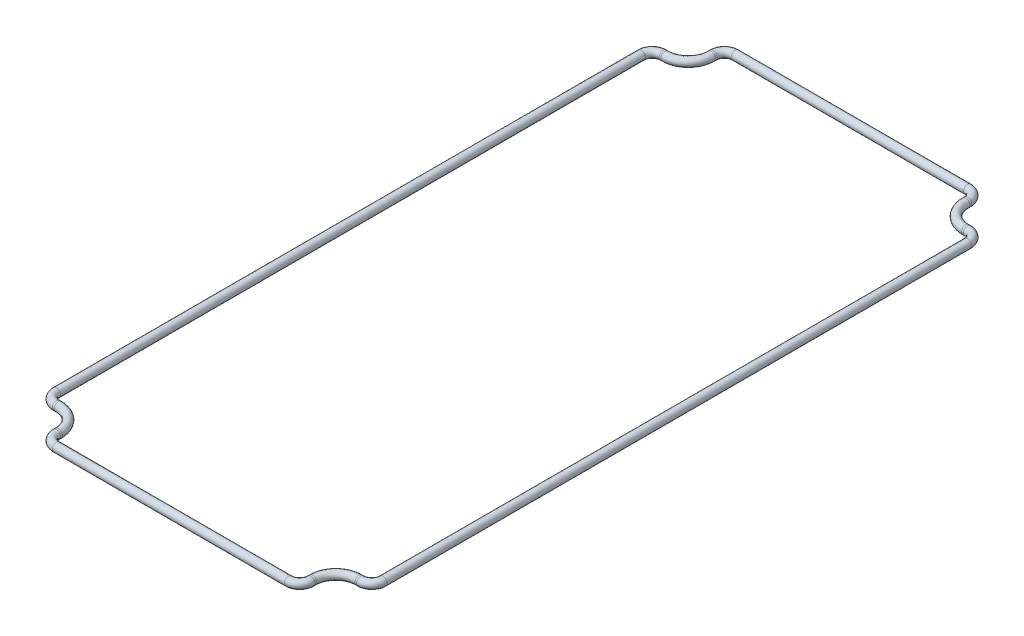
ISO-10303-21;
HEADER;
FILE_DESCRIPTION(('STEP AP214'),'2;1');
FILE_NAME('part.step','',(''),(''),'','','');
FILE_SCHEMA(('AUTOMOTIVE_DESIGN { 1 0 10303 214 1 1 1 1 }'));
ENDSEC;
DATA;
#1=APPLICATION_CONTEXT('core data for automotive mechanical design processes');
#2=APPLICATION_PROTOCOL_DEFINITION('international standard','automotive_design',2000,#1);
#3=PRODUCT_CONTEXT('',#1,'mechanical');
#4=PRODUCT('Part','Part','',(#3));
#5=PRODUCT_RELATED_PRODUCT_CATEGORY('part','',(#4));
#6=PRODUCT_DEFINITION_FORMATION('','',#4);
#7=PRODUCT_DEFINITION_CONTEXT('part definition',#1,'design');
#8=PRODUCT_DEFINITION('design','',#6,#7);
#9=PRODUCT_DEFINITION_SHAPE('','',#8);
#10=(LENGTH_UNIT() NAMED_UNIT(*) SI_UNIT(.MILLI.,.METRE.));
#11=(NAMED_UNIT(*) PLANE_ANGLE_UNIT() SI_UNIT($,.RADIAN.));
#12=(NAMED_UNIT(*) SI_UNIT($,.STERADIAN.) SOLID_ANGLE_UNIT());
#13=UNCERTAINTY_MEASURE_WITH_UNIT(LENGTH_MEASURE(1.E-05),#10,'distance_accuracy_value','');
#14=(GEOMETRIC_REPRESENTATION_CONTEXT(3) GLOBAL_UNCERTAINTY_ASSIGNED_CONTEXT((#13)) GLOBAL_UNIT_ASSIGNED_CONTEXT((#10,
#11,#12)) REPRESENTATION_CONTEXT('',''));
#15=CARTESIAN_POINT('',(0.,0.,0.));
#16=DIRECTION('',(0.,0.,1.));
#17=DIRECTION('',(1.,0.,0.));
#18=AXIS2_PLACEMENT_3D('',#15,#16,#17);
#19=CARTESIAN_POINT('',(43.38664,26.035,83.34964));
#20=DIRECTION('',(0.,1.,0.));
#21=DIRECTION('',(0.,0.,1.));
#22=AXIS2_PLACEMENT_3D('',#19,#20,#21);
#23=TOROIDAL_SURFACE('',#22,3.14705999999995,1.190625);
#24=CARTESIAN_POINT('',(43.38664,26.035,86.4966999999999));
#25=DIRECTION('',(-1.,0.,0.));
#26=DIRECTION('',(0.,0.,1.));
#27=AXIS2_PLACEMENT_3D('',#24,#25,#26);
#28=CIRCLE('',#27,1.190625);
#29=CARTESIAN_POINT('',(43.3866399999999,26.035,87.6873249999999));
#30=VERTEX_POINT('',#29);
#31=EDGE_CURVE('E28',#30,#30,#28,.T.);
#32=CARTESIAN_POINT('',(46.5336999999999,26.035,83.34964));
#33=DIRECTION('',(0.,0.,1.));
#34=DIRECTION('',(1.,0.,0.));
#35=AXIS2_PLACEMENT_3D('',#32,#33,#34);
#36=CIRCLE('',#35,1.190625);
#37=CARTESIAN_POINT('',(47.724325,26.035,83.3496400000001));
#38=VERTEX_POINT('',#37);
#39=EDGE_CURVE('E10',#38,#38,#36,.T.);
#40=CARTESIAN_POINT('',(43.38664,26.035,83.34964));
#41=DIRECTION('',(0.,1.,0.));
#42=DIRECTION('',(0.,0.,1.));
#43=AXIS2_PLACEMENT_3D('',#40,#41,#42);
#44=CIRCLE('',#43,4.33768499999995);
#45=EDGE_CURVE('',#30,#38,#44,.T.);
#46=ORIENTED_EDGE('',*,*,#31,.F.);
#47=ORIENTED_EDGE('',*,*,#39,.T.);
#48=ORIENTED_EDGE('',*,*,#45,.T.);
#49=ORIENTED_EDGE('',*,*,#45,.F.);
#50=EDGE_LOOP('',(#46,#48,#47,#49));
#51=FACE_BOUND('',#50,.T.);
#52=ADVANCED_FACE('F22',(#51),#23,.T.);
#53=CARTESIAN_POINT('',(42.84816,26.035,86.4966999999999));
#54=DIRECTION('',(1.,0.,0.));
#55=DIRECTION('',(0.,0.,-1.));
#56=AXIS2_PLACEMENT_3D('',#53,#54,#55);
#57=CYLINDRICAL_SURFACE('',#56,1.190625);
#58=CARTESIAN_POINT('',(42.84816,26.035,86.4966999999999));
#59=DIRECTION('',(-1.,0.,0.));
#60=DIRECTION('',(0.,0.,1.));
#61=AXIS2_PLACEMENT_3D('',#58,#59,#60);
#62=CIRCLE('',#61,1.190625);
#63=CARTESIAN_POINT('',(42.84816,26.035,85.3060749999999));
#64=VERTEX_POINT('',#63);
#65=EDGE_CURVE('E32',#64,#64,#62,.T.);
#66=ORIENTED_EDGE('',*,*,#65,.F.);
#67=EDGE_LOOP('',(#66));
#68=FACE_BOUND('',#67,.T.);
#69=ORIENTED_EDGE('',*,*,#31,.T.);
#70=EDGE_LOOP('',(#69));
#71=FACE_BOUND('',#70,.T.);
#72=ADVANCED_FACE('F228',(#68,#71),#57,.T.);
#73=CARTESIAN_POINT('',(42.84816,26.035,93.09816));
#74=DIRECTION('',(0.,-1.,0.));
#75=DIRECTION('',(0.,0.,-1.));
#76=AXIS2_PLACEMENT_3D('',#73,#74,#75);
#77=TOROIDAL_SURFACE('',#76,6.60146000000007,1.190625);
#78=CARTESIAN_POINT('',(36.2466999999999,26.035,93.09816));
#79=DIRECTION('',(0.,0.,1.));
#80=DIRECTION('',(1.,0.,0.));
#81=AXIS2_PLACEMENT_3D('',#78,#79,#80);
#82=CIRCLE('',#81,1.190625);
#83=CARTESIAN_POINT('',(35.0560749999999,26.035,93.0981600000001));
#84=VERTEX_POINT('',#83);
#85=EDGE_CURVE('E36',#84,#84,#82,.T.);
#86=CARTESIAN_POINT('',(42.84816,26.035,93.09816));
#87=DIRECTION('',(0.,-1.,0.));
#88=DIRECTION('',(0.,0.,-1.));
#89=AXIS2_PLACEMENT_3D('',#86,#87,#88);
#90=CIRCLE('',#89,7.79208500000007);
#91=EDGE_CURVE('',#84,#64,#90,.T.);
#92=ORIENTED_EDGE('',*,*,#85,.F.);
#93=ORIENTED_EDGE('',*,*,#65,.T.);
#94=ORIENTED_EDGE('',*,*,#91,.T.);
#95=ORIENTED_EDGE('',*,*,#91,.F.);
#96=EDGE_LOOP('',(#92,#94,#93,#95));
#97=FACE_BOUND('',#96,.T.);
#98=ADVANCED_FACE('F222',(#97),#77,.T.);
#99=CARTESIAN_POINT('',(36.2466999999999,26.035,93.63664));
#100=DIRECTION('',(0.,0.,-1.));
#101=DIRECTION('',(-1.,0.,0.));
#102=AXIS2_PLACEMENT_3D('',#99,#100,#101);
#103=CYLINDRICAL_SURFACE('',#102,1.190625);
#104=CARTESIAN_POINT('',(36.2466999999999,26.035,93.63664));
#105=DIRECTION('',(0.,0.,1.));
#106=DIRECTION('',(1.,0.,0.));
#107=AXIS2_PLACEMENT_3D('',#104,#105,#106);
#108=CIRCLE('',#107,1.190625);
#109=CARTESIAN_POINT('',(37.437325,26.035,93.63664));
#110=VERTEX_POINT('',#109);
#111=EDGE_CURVE('E41',#110,#110,#108,.T.);
#112=ORIENTED_EDGE('',*,*,#111,.F.);
#113=EDGE_LOOP('',(#112));
#114=FACE_BOUND('',#113,.T.);
#115=ORIENTED_EDGE('',*,*,#85,.T.);
#116=EDGE_LOOP('',(#115));
#117=FACE_BOUND('',#116,.T.);
#118=ADVANCED_FACE('F216',(#114,#117),#103,.T.);
#119=CARTESIAN_POINT('',(33.09964,26.035,93.63664));
#120=DIRECTION('',(0.,1.,0.));
#121=DIRECTION('',(0.,0.,1.));
#122=AXIS2_PLACEMENT_3D('',#119,#120,#121);
#123=TOROIDAL_SURFACE('',#122,3.14705999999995,1.190625);
#124=CARTESIAN_POINT('',(33.09964,26.035,96.7836999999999));
#125=DIRECTION('',(-1.,0.,0.));
#126=DIRECTION('',(0.,0.,1.));
#127=AXIS2_PLACEMENT_3D('',#124,#125,#126);
#128=CIRCLE('',#127,1.190625);
#129=CARTESIAN_POINT('',(33.0996399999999,26.035,97.9743249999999));
#130=VERTEX_POINT('',#129);
#131=EDGE_CURVE('E44',#130,#130,#128,.T.);
#132=CARTESIAN_POINT('',(33.09964,26.035,93.63664));
#133=DIRECTION('',(0.,1.,0.));
#134=DIRECTION('',(0.,0.,1.));
#135=AXIS2_PLACEMENT_3D('',#132,#133,#134);
#136=CIRCLE('',#135,4.33768499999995);
#137=EDGE_CURVE('',#130,#110,#136,.T.);
#138=ORIENTED_EDGE('',*,*,#131,.F.);
#139=ORIENTED_EDGE('',*,*,#111,.T.);
#140=ORIENTED_EDGE('',*,*,#137,.T.);
#141=ORIENTED_EDGE('',*,*,#137,.F.);
#142=EDGE_LOOP('',(#138,#140,#139,#141));
#143=FACE_BOUND('',#142,.T.);
#144=ADVANCED_FACE('F210',(#143),#123,.T.);
#145=CARTESIAN_POINT('',(-33.0996400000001,26.035,96.7836999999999));
#146=DIRECTION('',(1.,0.,0.));
#147=DIRECTION('',(0.,0.,-1.));
#148=AXIS2_PLACEMENT_3D('',#145,#146,#147);
#149=CYLINDRICAL_SURFACE('',#148,1.190625);
#150=CARTESIAN_POINT('',(-33.0996400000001,26.035,96.7836999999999));
#151=DIRECTION('',(-1.,0.,0.));
#152=DIRECTION('',(0.,0.,1.));
#153=AXIS2_PLACEMENT_3D('',#150,#151,#152);
#154=CIRCLE('',#153,1.190625);
#155=CARTESIAN_POINT('',(-33.0996400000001,26.035,97.974325));
#156=VERTEX_POINT('',#155);
#157=EDGE_CURVE('E47',#156,#156,#154,.T.);
#158=ORIENTED_EDGE('',*,*,#157,.F.);
#159=EDGE_LOOP('',(#158));
#160=FACE_BOUND('',#159,.T.);
#161=ORIENTED_EDGE('',*,*,#131,.T.);
#162=EDGE_LOOP('',(#161));
#163=FACE_BOUND('',#162,.T.);
#164=ADVANCED_FACE('F204',(#160,#163),#149,.T.);
#165=CARTESIAN_POINT('',(-33.09964,26.035,93.63664));
#166=DIRECTION('',(0.,1.,0.));
#167=DIRECTION('',(0.,0.,1.));
#168=AXIS2_PLACEMENT_3D('',#165,#166,#167);
#169=TOROIDAL_SURFACE('',#168,3.14705999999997,1.190625);
#170=CARTESIAN_POINT('',(-36.2467,26.035,93.63664));
#171=DIRECTION('',(0.,0.,-1.));
#172=DIRECTION('',(-1.,0.,0.));
#173=AXIS2_PLACEMENT_3D('',#170,#171,#172);
#174=CIRCLE('',#173,1.190625);
#175=CARTESIAN_POINT('',(-37.437325,26.035,93.63664));
#176=VERTEX_POINT('',#175);
#177=EDGE_CURVE('E50',#176,#176,#174,.T.);
#178=CARTESIAN_POINT('',(-33.09964,26.035,93.63664));
#179=DIRECTION('',(0.,1.,0.));
#180=DIRECTION('',(0.,0.,1.));
#181=AXIS2_PLACEMENT_3D('',#178,#179,#180);
#182=CIRCLE('',#181,4.33768499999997);
#183=EDGE_CURVE('',#176,#156,#182,.T.);
#184=ORIENTED_EDGE('',*,*,#177,.F.);
#185=ORIENTED_EDGE('',*,*,#157,.T.);
#186=ORIENTED_EDGE('',*,*,#183,.T.);
#187=ORIENTED_EDGE('',*,*,#183,.F.);
#188=EDGE_LOOP('',(#184,#186,#185,#187));
#189=FACE_BOUND('',#188,.T.);
#190=ADVANCED_FACE('F198',(#189),#169,.T.);
#191=CARTESIAN_POINT('',(-36.2467,26.035,93.09816));
#192=DIRECTION('',(0.,0.,1.));
#193=DIRECTION('',(1.,0.,0.));
#194=AXIS2_PLACEMENT_3D('',#191,#192,#193);
#195=CYLINDRICAL_SURFACE('',#194,1.190625);
#196=CARTESIAN_POINT('',(-36.2467,26.035,93.09816));
#197=DIRECTION('',(0.,0.,-1.));
#198=DIRECTION('',(-1.,0.,0.));
#199=AXIS2_PLACEMENT_3D('',#196,#197,#198);
#200=CIRCLE('',#199,1.190625);
#201=CARTESIAN_POINT('',(-35.056075,26.035,93.09816));
#202=VERTEX_POINT('',#201);
#203=EDGE_CURVE('E53',#202,#202,#200,.T.);
#204=ORIENTED_EDGE('',*,*,#203,.F.);
#205=EDGE_LOOP('',(#204));
#206=FACE_BOUND('',#205,.T.);
#207=ORIENTED_EDGE('',*,*,#177,.T.);
#208=EDGE_LOOP('',(#207));
#209=FACE_BOUND('',#208,.T.);
#210=ADVANCED_FACE('F192',(#206,#209),#195,.T.);
#211=CARTESIAN_POINT('',(-42.84816,26.035,93.09816));
#212=DIRECTION('',(0.,-1.,0.));
#213=DIRECTION('',(0.,0.,-1.));
#214=AXIS2_PLACEMENT_3D('',#211,#212,#213);
#215=TOROIDAL_SURFACE('',#214,6.60146000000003,1.190625);
#216=CARTESIAN_POINT('',(-42.84816,26.035,86.4967));
#217=DIRECTION('',(-1.,0.,0.));
#218=DIRECTION('',(0.,0.,1.));
#219=AXIS2_PLACEMENT_3D('',#216,#217,#218);
#220=CIRCLE('',#219,1.190625);
#221=CARTESIAN_POINT('',(-42.84816,26.035,85.306075));
#222=VERTEX_POINT('',#221);
#223=EDGE_CURVE('E56',#222,#222,#220,.T.);
#224=CARTESIAN_POINT('',(-42.84816,26.035,93.09816));
#225=DIRECTION('',(0.,-1.,0.));
#226=DIRECTION('',(0.,0.,-1.));
#227=AXIS2_PLACEMENT_3D('',#224,#225,#226);
#228=CIRCLE('',#227,7.79208500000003);
#229=EDGE_CURVE('',#222,#202,#228,.T.);
#230=ORIENTED_EDGE('',*,*,#223,.F.);
#231=ORIENTED_EDGE('',*,*,#203,.T.);
#232=ORIENTED_EDGE('',*,*,#229,.T.);
#233=ORIENTED_EDGE('',*,*,#229,.F.);
#234=EDGE_LOOP('',(#230,#232,#231,#233));
#235=FACE_BOUND('',#234,.T.);
#236=ADVANCED_FACE('F186',(#235),#215,.T.);
#237=CARTESIAN_POINT('',(-43.38664,26.035,86.4967));
#238=DIRECTION('',(1.,0.,0.));
#239=DIRECTION('',(0.,1.,0.));
#240=AXIS2_PLACEMENT_3D('',#237,#238,#239);
#241=CYLINDRICAL_SURFACE('',#240,1.190625);
#242=CARTESIAN_POINT('',(-43.38664,26.035,86.4967));
#243=DIRECTION('',(-1.,0.,0.));
#244=DIRECTION('',(0.,0.,1.));
#245=AXIS2_PLACEMENT_3D('',#242,#243,#244);
#246=CIRCLE('',#245,1.190625);
#247=CARTESIAN_POINT('',(-43.38664,26.035,87.687325));
#248=VERTEX_POINT('',#247);
#249=EDGE_CURVE('E59',#248,#248,#246,.T.);
#250=ORIENTED_EDGE('',*,*,#249,.F.);
#251=EDGE_LOOP('',(#250));
#252=FACE_BOUND('',#251,.T.);
#253=ORIENTED_EDGE('',*,*,#223,.T.);
#254=EDGE_LOOP('',(#253));
#255=FACE_BOUND('',#254,.T.);
#256=ADVANCED_FACE('F180',(#252,#255),#241,.T.);
#257=CARTESIAN_POINT('',(-43.38664,26.035,83.34964));
#258=DIRECTION('',(0.,1.,0.));
#259=DIRECTION('',(0.,0.,1.));
#260=AXIS2_PLACEMENT_3D('',#257,#258,#259);
#261=TOROIDAL_SURFACE('',#260,3.14705999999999,1.190625);
#262=CARTESIAN_POINT('',(-46.5337,26.035,83.34964));
#263=DIRECTION('',(0.,0.,-1.));
#264=DIRECTION('',(-1.,0.,0.));
#265=AXIS2_PLACEMENT_3D('',#262,#263,#264);
#266=CIRCLE('',#265,1.190625);
#267=CARTESIAN_POINT('',(-47.724325,26.035,83.34964));
#268=VERTEX_POINT('',#267);
#269=EDGE_CURVE('E62',#268,#268,#266,.T.);
#270=CARTESIAN_POINT('',(-43.38664,26.035,83.34964));
#271=DIRECTION('',(0.,1.,0.));
#272=DIRECTION('',(0.,0.,1.));
#273=AXIS2_PLACEMENT_3D('',#270,#271,#272);
#274=CIRCLE('',#273,4.33768499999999);
#275=EDGE_CURVE('',#268,#248,#274,.T.);
#276=ORIENTED_EDGE('',*,*,#269,.F.);
#277=ORIENTED_EDGE('',*,*,#249,.T.);
#278=ORIENTED_EDGE('',*,*,#275,.T.);
#279=ORIENTED_EDGE('',*,*,#275,.F.);
#280=EDGE_LOOP('',(#276,#278,#277,#279));
#281=FACE_BOUND('',#280,.T.);
#282=ADVANCED_FACE('F174',(#281),#261,.T.);
#283=CARTESIAN_POINT('',(-46.5337,26.035,-83.34964));
#284=DIRECTION('',(0.,0.,1.));
#285=DIRECTION('',(1.,0.,0.));
#286=AXIS2_PLACEMENT_3D('',#283,#284,#285);
#287=CYLINDRICAL_SURFACE('',#286,1.190625);
#288=CARTESIAN_POINT('',(-46.5337,26.035,-83.34964));
#289=DIRECTION('',(0.,0.,-1.));
#290=DIRECTION('',(-1.,0.,0.));
#291=AXIS2_PLACEMENT_3D('',#288,#289,#290);
#292=CIRCLE('',#291,1.190625);
#293=CARTESIAN_POINT('',(-47.724325,26.035,-83.34964));
#294=VERTEX_POINT('',#293);
#295=EDGE_CURVE('E65',#294,#294,#292,.T.);
#296=ORIENTED_EDGE('',*,*,#295,.F.);
#297=EDGE_LOOP('',(#296));
#298=FACE_BOUND('',#297,.T.);
#299=ORIENTED_EDGE('',*,*,#269,.T.);
#300=EDGE_LOOP('',(#299));
#301=FACE_BOUND('',#300,.T.);
#302=ADVANCED_FACE('F168',(#298,#301),#287,.T.);
#303=CARTESIAN_POINT('',(-43.38664,26.035,-83.34964));
#304=DIRECTION('',(0.,1.,0.));
#305=DIRECTION('',(0.,0.,1.));
#306=AXIS2_PLACEMENT_3D('',#303,#304,#305);
#307=TOROIDAL_SURFACE('',#306,3.14705999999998,1.190625);
#308=CARTESIAN_POINT('',(-43.38664,26.035,-86.4966999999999));
#309=DIRECTION('',(1.,0.,0.));
#310=DIRECTION('',(0.,0.,-1.));
#311=AXIS2_PLACEMENT_3D('',#308,#309,#310);
#312=CIRCLE('',#311,1.190625);
#313=CARTESIAN_POINT('',(-43.38664,26.035,-87.687325));
#314=VERTEX_POINT('',#313);
#315=EDGE_CURVE('E68',#314,#314,#312,.T.);
#316=CARTESIAN_POINT('',(-43.38664,26.035,-83.34964));
#317=DIRECTION('',(0.,1.,0.));
#318=DIRECTION('',(0.,0.,1.));
#319=AXIS2_PLACEMENT_3D('',#316,#317,#318);
#320=CIRCLE('',#319,4.33768499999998);
#321=EDGE_CURVE('',#314,#294,#320,.T.);
#322=ORIENTED_EDGE('',*,*,#315,.F.);
#323=ORIENTED_EDGE('',*,*,#295,.T.);
#324=ORIENTED_EDGE('',*,*,#321,.T.);
#325=ORIENTED_EDGE('',*,*,#321,.F.);
#326=EDGE_LOOP('',(#322,#324,#323,#325));
#327=FACE_BOUND('',#326,.T.);
#328=ADVANCED_FACE('F162',(#327),#307,.T.);
#329=CARTESIAN_POINT('',(-42.84816,26.035,-86.4967));
#330=DIRECTION('',(-1.,0.,0.));
#331=DIRECTION('',(0.,0.,1.));
#332=AXIS2_PLACEMENT_3D('',#329,#330,#331);
#333=CYLINDRICAL_SURFACE('',#332,1.190625);
#334=CARTESIAN_POINT('',(-42.84816,26.035,-86.4967));
#335=DIRECTION('',(1.,0.,0.));
#336=DIRECTION('',(0.,0.,-1.));
#337=AXIS2_PLACEMENT_3D('',#334,#335,#336);
#338=CIRCLE('',#337,1.190625);
#339=CARTESIAN_POINT('',(-42.84816,26.035,-85.306075));
#340=VERTEX_POINT('',#339);
#341=EDGE_CURVE('E71',#340,#340,#338,.T.);
#342=ORIENTED_EDGE('',*,*,#341,.F.);
#343=EDGE_LOOP('',(#342));
#344=FACE_BOUND('',#343,.T.);
#345=ORIENTED_EDGE('',*,*,#315,.T.);
#346=EDGE_LOOP('',(#345));
#347=FACE_BOUND('',#346,.T.);
#348=ADVANCED_FACE('F156',(#344,#347),#333,.T.);
#349=CARTESIAN_POINT('',(-42.84816,26.035,-93.09816));
#350=DIRECTION('',(0.,-1.,0.));
#351=DIRECTION('',(0.,0.,-1.));
#352=AXIS2_PLACEMENT_3D('',#349,#350,#351);
#353=TOROIDAL_SURFACE('',#352,6.60146000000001,1.190625);
#354=CARTESIAN_POINT('',(-36.2467,26.035,-93.09816));
#355=DIRECTION('',(0.,0.,-1.));
#356=DIRECTION('',(-1.,0.,0.));
#357=AXIS2_PLACEMENT_3D('',#354,#355,#356);
#358=CIRCLE('',#357,1.190625);
#359=CARTESIAN_POINT('',(-35.056075,26.035,-93.09816));
#360=VERTEX_POINT('',#359);
#361=EDGE_CURVE('E74',#360,#360,#358,.T.);
#362=CARTESIAN_POINT('',(-42.84816,26.035,-93.09816));
#363=DIRECTION('',(0.,-1.,0.));
#364=DIRECTION('',(0.,0.,-1.));
#365=AXIS2_PLACEMENT_3D('',#362,#363,#364);
#366=CIRCLE('',#365,7.79208500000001);
#367=EDGE_CURVE('',#360,#340,#366,.T.);
#368=ORIENTED_EDGE('',*,*,#361,.F.);
#369=ORIENTED_EDGE('',*,*,#341,.T.);
#370=ORIENTED_EDGE('',*,*,#367,.T.);
#371=ORIENTED_EDGE('',*,*,#367,.F.);
#372=EDGE_LOOP('',(#368,#370,#369,#371));
#373=FACE_BOUND('',#372,.T.);
#374=ADVANCED_FACE('F150',(#373),#353,.T.);
#375=CARTESIAN_POINT('',(-36.2467,26.035,-93.63664));
#376=DIRECTION('',(0.,0.,1.));
#377=DIRECTION('',(0.,-1.,0.));
#378=AXIS2_PLACEMENT_3D('',#375,#376,#377);
#379=CYLINDRICAL_SURFACE('',#378,1.190625);
#380=CARTESIAN_POINT('',(-36.2467,26.035,-93.63664));
#381=DIRECTION('',(0.,0.,-1.));
#382=DIRECTION('',(-1.,0.,0.));
#383=AXIS2_PLACEMENT_3D('',#380,#381,#382);
#384=CIRCLE('',#383,1.190625);
#385=CARTESIAN_POINT('',(-37.4373250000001,26.035,-93.63664));
#386=VERTEX_POINT('',#385);
#387=EDGE_CURVE('E77',#386,#386,#384,.T.);
#388=ORIENTED_EDGE('',*,*,#387,.F.);
#389=EDGE_LOOP('',(#388));
#390=FACE_BOUND('',#389,.T.);
#391=ORIENTED_EDGE('',*,*,#361,.T.);
#392=EDGE_LOOP('',(#391));
#393=FACE_BOUND('',#392,.T.);
#394=ADVANCED_FACE('F144',(#390,#393),#379,.T.);
#395=CARTESIAN_POINT('',(-33.0996400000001,26.035,-93.63664));
#396=DIRECTION('',(0.,1.,0.));
#397=DIRECTION('',(0.,0.,1.));
#398=AXIS2_PLACEMENT_3D('',#395,#396,#397);
#399=TOROIDAL_SURFACE('',#398,3.14705999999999,1.190625);
#400=CARTESIAN_POINT('',(-33.09964,26.035,-96.7837));
#401=DIRECTION('',(1.,0.,0.));
#402=DIRECTION('',(0.,0.,-1.));
#403=AXIS2_PLACEMENT_3D('',#400,#401,#402);
#404=CIRCLE('',#403,1.190625);
#405=CARTESIAN_POINT('',(-33.09964,26.035,-97.974325));
#406=VERTEX_POINT('',#405);
#407=EDGE_CURVE('E80',#406,#406,#404,.T.);
#408=CARTESIAN_POINT('',(-33.0996400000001,26.035,-93.63664));
#409=DIRECTION('',(0.,1.,0.));
#410=DIRECTION('',(0.,0.,1.));
#411=AXIS2_PLACEMENT_3D('',#408,#409,#410);
#412=CIRCLE('',#411,4.337685);
#413=EDGE_CURVE('',#406,#386,#412,.T.);
#414=ORIENTED_EDGE('',*,*,#407,.F.);
#415=ORIENTED_EDGE('',*,*,#387,.T.);
#416=ORIENTED_EDGE('',*,*,#413,.T.);
#417=ORIENTED_EDGE('',*,*,#413,.F.);
#418=EDGE_LOOP('',(#414,#416,#415,#417));
#419=FACE_BOUND('',#418,.T.);
#420=ADVANCED_FACE('F138',(#419),#399,.T.);
#421=CARTESIAN_POINT('',(33.09964,26.035,-96.7837));
#422=DIRECTION('',(-1.,0.,0.));
#423=DIRECTION('',(0.,0.,1.));
#424=AXIS2_PLACEMENT_3D('',#421,#422,#423);
#425=CYLINDRICAL_SURFACE('',#424,1.190625);
#426=CARTESIAN_POINT('',(33.09964,26.035,-96.7837));
#427=DIRECTION('',(1.,0.,0.));
#428=DIRECTION('',(0.,0.,-1.));
#429=AXIS2_PLACEMENT_3D('',#426,#427,#428);
#430=CIRCLE('',#429,1.190625);
#431=CARTESIAN_POINT('',(33.09964,26.035,-97.974325));
#432=VERTEX_POINT('',#431);
#433=EDGE_CURVE('E83',#432,#432,#430,.T.);
#434=ORIENTED_EDGE('',*,*,#433,.F.);
#435=EDGE_LOOP('',(#434));
#436=FACE_BOUND('',#435,.T.);
#437=ORIENTED_EDGE('',*,*,#407,.T.);
#438=EDGE_LOOP('',(#437));
#439=FACE_BOUND('',#438,.T.);
#440=ADVANCED_FACE('F132',(#436,#439),#425,.T.);
#441=CARTESIAN_POINT('',(33.09964,26.035,-93.63664));
#442=DIRECTION('',(0.,1.,0.));
#443=DIRECTION('',(0.,0.,1.));
#444=AXIS2_PLACEMENT_3D('',#441,#442,#443);
#445=TOROIDAL_SURFACE('',#444,3.14705999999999,1.190625);
#446=CARTESIAN_POINT('',(36.2467,26.035,-93.6366400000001));
#447=DIRECTION('',(0.,0.,1.));
#448=DIRECTION('',(1.,0.,0.));
#449=AXIS2_PLACEMENT_3D('',#446,#447,#448);
#450=CIRCLE('',#449,1.190625);
#451=CARTESIAN_POINT('',(37.437325,26.035,-93.6366400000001));
#452=VERTEX_POINT('',#451);
#453=EDGE_CURVE('E86',#452,#452,#450,.T.);
#454=CARTESIAN_POINT('',(33.09964,26.035,-93.63664));
#455=DIRECTION('',(0.,1.,0.));
#456=DIRECTION('',(0.,0.,1.));
#457=AXIS2_PLACEMENT_3D('',#454,#455,#456);
#458=CIRCLE('',#457,4.337685);
#459=EDGE_CURVE('',#452,#432,#458,.T.);
#460=ORIENTED_EDGE('',*,*,#453,.F.);
#461=ORIENTED_EDGE('',*,*,#433,.T.);
#462=ORIENTED_EDGE('',*,*,#459,.T.);
#463=ORIENTED_EDGE('',*,*,#459,.F.);
#464=EDGE_LOOP('',(#460,#462,#461,#463));
#465=FACE_BOUND('',#464,.T.);
#466=ADVANCED_FACE('F126',(#465),#445,.T.);
#467=CARTESIAN_POINT('',(36.2467,26.035,-93.09816));
#468=DIRECTION('',(0.,0.,-1.));
#469=DIRECTION('',(-1.,0.,0.));
#470=AXIS2_PLACEMENT_3D('',#467,#468,#469);
#471=CYLINDRICAL_SURFACE('',#470,1.190625);
#472=CARTESIAN_POINT('',(36.2467,26.035,-93.09816));
#473=DIRECTION('',(0.,0.,1.));
#474=DIRECTION('',(1.,0.,0.));
#475=AXIS2_PLACEMENT_3D('',#472,#473,#474);
#476=CIRCLE('',#475,1.190625);
#477=CARTESIAN_POINT('',(35.056075,26.035,-93.09816));
#478=VERTEX_POINT('',#477);
#479=EDGE_CURVE('E89',#478,#478,#476,.T.);
#480=ORIENTED_EDGE('',*,*,#479,.F.);
#481=EDGE_LOOP('',(#480));
#482=FACE_BOUND('',#481,.T.);
#483=ORIENTED_EDGE('',*,*,#453,.T.);
#484=EDGE_LOOP('',(#483));
#485=FACE_BOUND('',#484,.T.);
#486=ADVANCED_FACE('F120',(#482,#485),#471,.T.);
#487=CARTESIAN_POINT('',(42.84816,26.035,-93.09816));
#488=DIRECTION('',(0.,-1.,0.));
#489=DIRECTION('',(0.,0.,-1.));
#490=AXIS2_PLACEMENT_3D('',#487,#488,#489);
#491=TOROIDAL_SURFACE('',#490,6.60146000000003,1.190625);
#492=CARTESIAN_POINT('',(42.84816,26.035,-86.4967));
#493=DIRECTION('',(1.,0.,0.));
#494=DIRECTION('',(0.,0.,-1.));
#495=AXIS2_PLACEMENT_3D('',#492,#493,#494);
#496=CIRCLE('',#495,1.190625);
#497=CARTESIAN_POINT('',(42.8481599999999,26.035,-85.306075));
#498=VERTEX_POINT('',#497);
#499=EDGE_CURVE('E92',#498,#498,#496,.T.);
#500=CARTESIAN_POINT('',(42.84816,26.035,-93.09816));
#501=DIRECTION('',(0.,-1.,0.));
#502=DIRECTION('',(0.,0.,-1.));
#503=AXIS2_PLACEMENT_3D('',#500,#501,#502);
#504=CIRCLE('',#503,7.79208500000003);
#505=EDGE_CURVE('',#498,#478,#504,.T.);
#506=ORIENTED_EDGE('',*,*,#499,.F.);
#507=ORIENTED_EDGE('',*,*,#479,.T.);
#508=ORIENTED_EDGE('',*,*,#505,.T.);
#509=ORIENTED_EDGE('',*,*,#505,.F.);
#510=EDGE_LOOP('',(#506,#508,#507,#509));
#511=FACE_BOUND('',#510,.T.);
#512=ADVANCED_FACE('F114',(#511),#491,.T.);
#513=CARTESIAN_POINT('',(43.38664,26.035,-86.4967));
#514=DIRECTION('',(-1.,0.,0.));
#515=DIRECTION('',(0.,0.,1.));
#516=AXIS2_PLACEMENT_3D('',#513,#514,#515);
#517=CYLINDRICAL_SURFACE('',#516,1.190625);
#518=CARTESIAN_POINT('',(43.38664,26.035,-86.4967));
#519=DIRECTION('',(1.,0.,0.));
#520=DIRECTION('',(0.,0.,-1.));
#521=AXIS2_PLACEMENT_3D('',#518,#519,#520);
#522=CIRCLE('',#521,1.190625);
#523=CARTESIAN_POINT('',(43.38664,26.035,-87.687325));
#524=VERTEX_POINT('',#523);
#525=EDGE_CURVE('E95',#524,#524,#522,.T.);
#526=ORIENTED_EDGE('',*,*,#525,.F.);
#527=EDGE_LOOP('',(#526));
#528=FACE_BOUND('',#527,.T.);
#529=ORIENTED_EDGE('',*,*,#499,.T.);
#530=EDGE_LOOP('',(#529));
#531=FACE_BOUND('',#530,.T.);
#532=ADVANCED_FACE('F108',(#528,#531),#517,.T.);
#533=CARTESIAN_POINT('',(43.38664,26.035,-83.34964));
#534=DIRECTION('',(0.,1.,0.));
#535=DIRECTION('',(0.,0.,1.));
#536=AXIS2_PLACEMENT_3D('',#533,#534,#535);
#537=TOROIDAL_SURFACE('',#536,3.14706,1.190625);
#538=CARTESIAN_POINT('',(46.5337,26.035,-83.34964));
#539=DIRECTION('',(0.,0.,1.));
#540=DIRECTION('',(1.,0.,0.));
#541=AXIS2_PLACEMENT_3D('',#538,#539,#540);
#542=CIRCLE('',#541,1.190625);
#543=CARTESIAN_POINT('',(47.724325,26.035,-83.34964));
#544=VERTEX_POINT('',#543);
#545=EDGE_CURVE('E98',#544,#544,#542,.T.);
#546=CARTESIAN_POINT('',(43.38664,26.035,-83.34964));
#547=DIRECTION('',(0.,1.,0.));
#548=DIRECTION('',(0.,0.,1.));
#549=AXIS2_PLACEMENT_3D('',#546,#547,#548);
#550=CIRCLE('',#549,4.337685);
#551=EDGE_CURVE('',#544,#524,#550,.T.);
#552=ORIENTED_EDGE('',*,*,#545,.F.);
#553=ORIENTED_EDGE('',*,*,#525,.T.);
#554=ORIENTED_EDGE('',*,*,#551,.T.);
#555=ORIENTED_EDGE('',*,*,#551,.F.);
#556=EDGE_LOOP('',(#552,#554,#553,#555));
#557=FACE_BOUND('',#556,.T.);
#558=ADVANCED_FACE('F105',(#557),#537,.T.);
#559=CARTESIAN_POINT('',(46.5337,26.035,-83.34964));
#560=DIRECTION('',(0.,0.,1.));
#561=DIRECTION('',(0.,-1.,0.));
#562=AXIS2_PLACEMENT_3D('',#559,#560,#561);
#563=CYLINDRICAL_SURFACE('',#562,1.190625);
#564=ORIENTED_EDGE('',*,*,#545,.T.);
#565=EDGE_LOOP('',(#564));
#566=FACE_BOUND('',#565,.T.);
#567=ORIENTED_EDGE('',*,*,#39,.F.);
#568=EDGE_LOOP('',(#567));
#569=FACE_BOUND('',#568,.T.);
#570=ADVANCED_FACE('F102',(#566,#569),#563,.T.);
#571=CLOSED_SHELL('',(#52,#72,#98,#118,#144,#164,#190,#210,#236,#256,#282,#302,#328,#348,#374,
#394,#420,#440,#466,#486,#512,#532,#558,#570));
#572=MANIFOLD_SOLID_BREP('B2',#571);
#573=ADVANCED_BREP_SHAPE_REPRESENTATION('',(#18,#572),#14);
#574=SHAPE_DEFINITION_REPRESENTATION(#9,#573);
ENDSEC;
END-ISO-10303-21;
